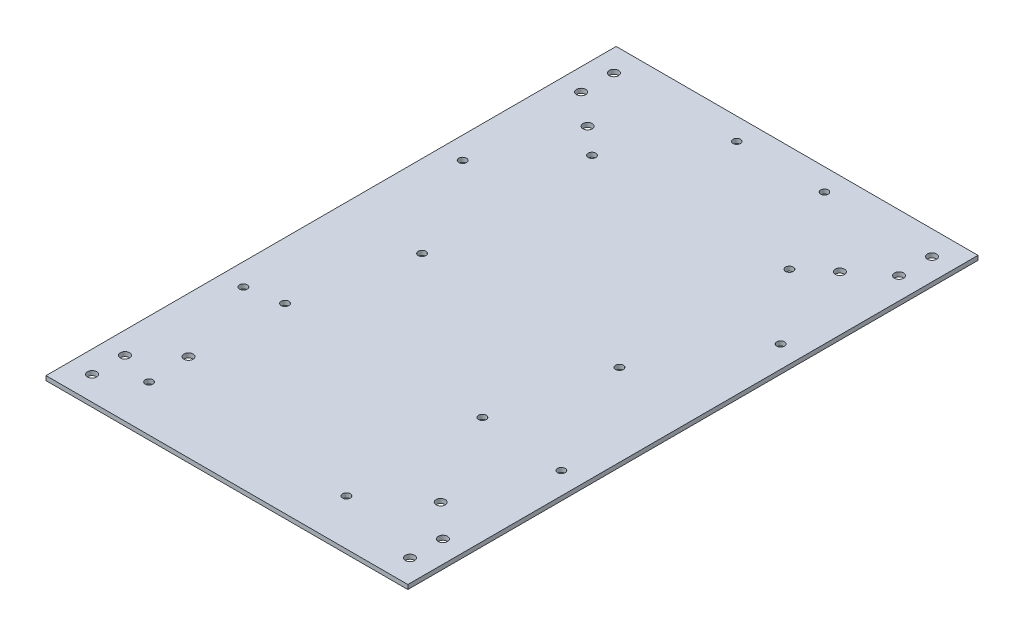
ISO-10303-21;
HEADER;
FILE_DESCRIPTION(('STEP AP214'),'2;1');
FILE_NAME('part.step','',(''),(''),'','','');
FILE_SCHEMA(('AUTOMOTIVE_DESIGN { 1 0 10303 214 1 1 1 1 }'));
ENDSEC;
DATA;
#1=APPLICATION_CONTEXT('core data for automotive mechanical design processes');
#2=APPLICATION_PROTOCOL_DEFINITION('international standard','automotive_design',2000,#1);
#3=PRODUCT_CONTEXT('',#1,'mechanical');
#4=PRODUCT('Part','Part','',(#3));
#5=PRODUCT_RELATED_PRODUCT_CATEGORY('part','',(#4));
#6=PRODUCT_DEFINITION_FORMATION('','',#4);
#7=PRODUCT_DEFINITION_CONTEXT('part definition',#1,'design');
#8=PRODUCT_DEFINITION('design','',#6,#7);
#9=PRODUCT_DEFINITION_SHAPE('','',#8);
#10=(LENGTH_UNIT() NAMED_UNIT(*) SI_UNIT(.MILLI.,.METRE.));
#11=(NAMED_UNIT(*) PLANE_ANGLE_UNIT() SI_UNIT($,.RADIAN.));
#12=(NAMED_UNIT(*) SI_UNIT($,.STERADIAN.) SOLID_ANGLE_UNIT());
#13=UNCERTAINTY_MEASURE_WITH_UNIT(LENGTH_MEASURE(1.E-05),#10,'distance_accuracy_value','');
#14=(GEOMETRIC_REPRESENTATION_CONTEXT(3) GLOBAL_UNCERTAINTY_ASSIGNED_CONTEXT((#13)) GLOBAL_UNIT_ASSIGNED_CONTEXT((#10,
#11,#12)) REPRESENTATION_CONTEXT('',''));
#15=CARTESIAN_POINT('',(0.,0.,0.));
#16=DIRECTION('',(0.,0.,1.));
#17=DIRECTION('',(1.,0.,0.));
#18=AXIS2_PLACEMENT_3D('',#15,#16,#17);
#19=CARTESIAN_POINT('',(82.,-2.,-122.55705739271));
#20=DIRECTION('',(1.,0.,0.));
#21=DIRECTION('',(0.,0.,-1.));
#22=AXIS2_PLACEMENT_3D('',#19,#20,#21);
#23=PLANE('',#22);
#24=DIRECTION('',(0.,0.,-1.));
#25=VECTOR('',#24,1.);
#26=CARTESIAN_POINT('',(82.,0.,-122.55705739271));
#27=LINE('',#26,#25);
#28=CARTESIAN_POINT('',(82.,0.,137.44294260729));
#29=VERTEX_POINT('',#28);
#30=CARTESIAN_POINT('',(82.,0.,-122.55705739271));
#31=VERTEX_POINT('',#30);
#32=EDGE_CURVE('E104',#29,#31,#27,.T.);
#33=ORIENTED_EDGE('',*,*,#32,.F.);
#34=DIRECTION('',(0.,1.,0.));
#35=VECTOR('',#34,1.);
#36=CARTESIAN_POINT('',(82.,-2.,137.44294260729));
#37=LINE('',#36,#35);
#38=CARTESIAN_POINT('',(82.,-2.,137.44294260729));
#39=VERTEX_POINT('',#38);
#40=EDGE_CURVE('E11',#39,#29,#37,.T.);
#41=ORIENTED_EDGE('',*,*,#40,.F.);
#42=DIRECTION('',(0.,0.,-1.));
#43=VECTOR('',#42,1.);
#44=CARTESIAN_POINT('',(82.,-2.,-122.55705739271));
#45=LINE('',#44,#43);
#46=CARTESIAN_POINT('',(82.,-2.,-122.55705739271));
#47=VERTEX_POINT('',#46);
#48=EDGE_CURVE('E97',#39,#47,#45,.T.);
#49=ORIENTED_EDGE('',*,*,#48,.T.);
#50=DIRECTION('',(0.,1.,0.));
#51=VECTOR('',#50,1.);
#52=CARTESIAN_POINT('',(82.,-2.,-122.55705739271));
#53=LINE('',#52,#51);
#54=EDGE_CURVE('E42',#47,#31,#53,.T.);
#55=ORIENTED_EDGE('',*,*,#54,.T.);
#56=EDGE_LOOP('',(#33,#41,#49,#55));
#57=FACE_BOUND('',#56,.T.);
#58=ADVANCED_FACE('F39',(#57),#23,.T.);
#59=CARTESIAN_POINT('',(-83.,-2.,137.44294260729));
#60=DIRECTION('',(0.,0.,1.));
#61=DIRECTION('',(1.,0.,0.));
#62=AXIS2_PLACEMENT_3D('',#59,#60,#61);
#63=PLANE('',#62);
#64=DIRECTION('',(1.,0.,0.));
#65=VECTOR('',#64,1.);
#66=CARTESIAN_POINT('',(-83.,0.,137.44294260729));
#67=LINE('',#66,#65);
#68=CARTESIAN_POINT('',(-83.,0.,137.44294260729));
#69=VERTEX_POINT('',#68);
#70=EDGE_CURVE('E99',#69,#29,#67,.T.);
#71=ORIENTED_EDGE('',*,*,#70,.F.);
#72=DIRECTION('',(0.,1.,0.));
#73=VECTOR('',#72,1.);
#74=CARTESIAN_POINT('',(-83.,-2.,137.44294260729));
#75=LINE('',#74,#73);
#76=CARTESIAN_POINT('',(-83.,-2.,137.44294260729));
#77=VERTEX_POINT('',#76);
#78=EDGE_CURVE('E48',#77,#69,#75,.T.);
#79=ORIENTED_EDGE('',*,*,#78,.F.);
#80=DIRECTION('',(1.,0.,0.));
#81=VECTOR('',#80,1.);
#82=CARTESIAN_POINT('',(-83.,-2.,137.44294260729));
#83=LINE('',#82,#81);
#84=EDGE_CURVE('E94',#77,#39,#83,.T.);
#85=ORIENTED_EDGE('',*,*,#84,.T.);
#86=ORIENTED_EDGE('',*,*,#40,.T.);
#87=EDGE_LOOP('',(#71,#79,#85,#86));
#88=FACE_BOUND('',#87,.T.);
#89=ADVANCED_FACE('F115',(#88),#63,.T.);
#90=CARTESIAN_POINT('',(-83.,-2.,-122.55705739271));
#91=DIRECTION('',(-1.,0.,0.));
#92=DIRECTION('',(0.,0.,1.));
#93=AXIS2_PLACEMENT_3D('',#90,#91,#92);
#94=PLANE('',#93);
#95=DIRECTION('',(0.,0.,1.));
#96=VECTOR('',#95,1.);
#97=CARTESIAN_POINT('',(-83.,0.,-122.55705739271));
#98=LINE('',#97,#96);
#99=CARTESIAN_POINT('',(-83.,0.,-122.55705739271));
#100=VERTEX_POINT('',#99);
#101=EDGE_CURVE('E89',#100,#69,#98,.T.);
#102=ORIENTED_EDGE('',*,*,#101,.F.);
#103=DIRECTION('',(0.,1.,0.));
#104=VECTOR('',#103,1.);
#105=CARTESIAN_POINT('',(-83.,-2.,-122.55705739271));
#106=LINE('',#105,#104);
#107=CARTESIAN_POINT('',(-83.,-2.,-122.55705739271));
#108=VERTEX_POINT('',#107);
#109=EDGE_CURVE('E84',#108,#100,#106,.T.);
#110=ORIENTED_EDGE('',*,*,#109,.F.);
#111=DIRECTION('',(0.,0.,1.));
#112=VECTOR('',#111,1.);
#113=CARTESIAN_POINT('',(-83.,-2.,-122.55705739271));
#114=LINE('',#113,#112);
#115=EDGE_CURVE('E87',#108,#77,#114,.T.);
#116=ORIENTED_EDGE('',*,*,#115,.T.);
#117=ORIENTED_EDGE('',*,*,#78,.T.);
#118=EDGE_LOOP('',(#102,#110,#116,#117));
#119=FACE_BOUND('',#118,.T.);
#120=ADVANCED_FACE('F86',(#119),#94,.T.);
#121=CARTESIAN_POINT('',(-83.,-2.,-122.55705739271));
#122=DIRECTION('',(0.,0.,-1.));
#123=DIRECTION('',(-1.,0.,0.));
#124=AXIS2_PLACEMENT_3D('',#121,#122,#123);
#125=PLANE('',#124);
#126=DIRECTION('',(-1.,0.,0.));
#127=VECTOR('',#126,1.);
#128=CARTESIAN_POINT('',(-83.,0.,-122.55705739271));
#129=LINE('',#128,#127);
#130=EDGE_CURVE('E107',#31,#100,#129,.T.);
#131=ORIENTED_EDGE('',*,*,#130,.F.);
#132=ORIENTED_EDGE('',*,*,#54,.F.);
#133=DIRECTION('',(-1.,0.,0.));
#134=VECTOR('',#133,1.);
#135=CARTESIAN_POINT('',(-83.,-2.,-122.55705739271));
#136=LINE('',#135,#134);
#137=EDGE_CURVE('E93',#47,#108,#136,.T.);
#138=ORIENTED_EDGE('',*,*,#137,.T.);
#139=ORIENTED_EDGE('',*,*,#109,.T.);
#140=EDGE_LOOP('',(#131,#132,#138,#139));
#141=FACE_BOUND('',#140,.T.);
#142=ADVANCED_FACE('F96',(#141),#125,.T.);
#143=CARTESIAN_POINT('',(0.,-2.,0.));
#144=DIRECTION('',(0.,1.,0.));
#145=DIRECTION('',(0.,0.,1.));
#146=AXIS2_PLACEMENT_3D('',#143,#144,#145);
#147=PLANE('',#146);
#148=CARTESIAN_POINT('',(22.,-2.,-112.55705739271));
#149=DIRECTION('',(0.,1.,0.));
#150=DIRECTION('',(0.,0.,1.));
#151=AXIS2_PLACEMENT_3D('',#148,#149,#150);
#152=CIRCLE('',#151,1.70000000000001);
#153=CARTESIAN_POINT('',(22.,-2.,-110.85705739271));
#154=VERTEX_POINT('',#153);
#155=EDGE_CURVE('E273',#154,#154,#152,.F.);
#156=ORIENTED_EDGE('',*,*,#155,.F.);
#157=EDGE_LOOP('',(#156));
#158=FACE_BOUND('',#157,.T.);
#159=CARTESIAN_POINT('',(-18.,-2.,-112.55705739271));
#160=DIRECTION('',(0.,1.,0.));
#161=DIRECTION('',(0.,0.,1.));
#162=AXIS2_PLACEMENT_3D('',#159,#160,#161);
#163=CIRCLE('',#162,1.70000000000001);
#164=CARTESIAN_POINT('',(-18.,-2.,-110.85705739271));
#165=VERTEX_POINT('',#164);
#166=EDGE_CURVE('E267',#165,#165,#163,.F.);
#167=ORIENTED_EDGE('',*,*,#166,.F.);
#168=EDGE_LOOP('',(#167));
#169=FACE_BOUND('',#168,.T.);
#170=CARTESIAN_POINT('',(44.5,-2.,-74.0570573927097));
#171=DIRECTION('',(0.,1.,0.));
#172=DIRECTION('',(0.,0.,1.));
#173=AXIS2_PLACEMENT_3D('',#170,#171,#172);
#174=CIRCLE('',#173,1.75);
#175=CARTESIAN_POINT('',(44.5,-2.,-72.3070573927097));
#176=VERTEX_POINT('',#175);
#177=EDGE_CURVE('E261',#176,#176,#174,.F.);
#178=ORIENTED_EDGE('',*,*,#177,.F.);
#179=EDGE_LOOP('',(#178));
#180=FACE_BOUND('',#179,.T.);
#181=CARTESIAN_POINT('',(-45.5,-2.,-74.0570573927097));
#182=DIRECTION('',(0.,1.,0.));
#183=DIRECTION('',(0.,0.,1.));
#184=AXIS2_PLACEMENT_3D('',#181,#182,#183);
#185=CIRCLE('',#184,1.75);
#186=CARTESIAN_POINT('',(-45.5,-2.,-72.3070573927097));
#187=VERTEX_POINT('',#186);
#188=EDGE_CURVE('E255',#187,#187,#185,.F.);
#189=ORIENTED_EDGE('',*,*,#188,.F.);
#190=EDGE_LOOP('',(#189));
#191=FACE_BOUND('',#190,.T.);
#192=CARTESIAN_POINT('',(-45.5000000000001,-2.,3.4429426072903));
#193=DIRECTION('',(0.,1.,0.));
#194=DIRECTION('',(0.,0.,1.));
#195=AXIS2_PLACEMENT_3D('',#192,#193,#194);
#196=CIRCLE('',#195,1.75);
#197=CARTESIAN_POINT('',(-45.5000000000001,-2.,5.1929426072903));
#198=VERTEX_POINT('',#197);
#199=EDGE_CURVE('E248',#198,#198,#196,.F.);
#200=ORIENTED_EDGE('',*,*,#199,.F.);
#201=EDGE_LOOP('',(#200));
#202=FACE_BOUND('',#201,.T.);
#203=CARTESIAN_POINT('',(-57.,-2.,54.4429426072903));
#204=DIRECTION('',(0.,1.,0.));
#205=DIRECTION('',(0.,0.,1.));
#206=AXIS2_PLACEMENT_3D('',#203,#204,#205);
#207=CIRCLE('',#206,1.75);
#208=CARTESIAN_POINT('',(-57.,-2.,56.1929426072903));
#209=VERTEX_POINT('',#208);
#210=EDGE_CURVE('E293',#209,#209,#207,.F.);
#211=ORIENTED_EDGE('',*,*,#210,.F.);
#212=EDGE_LOOP('',(#211));
#213=FACE_BOUND('',#212,.T.);
#214=CARTESIAN_POINT('',(33.,-2.,54.4429426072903));
#215=DIRECTION('',(0.,1.,0.));
#216=DIRECTION('',(0.,0.,1.));
#217=AXIS2_PLACEMENT_3D('',#214,#215,#216);
#218=CIRCLE('',#217,1.75);
#219=CARTESIAN_POINT('',(33.,-2.,56.1929426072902));
#220=VERTEX_POINT('',#219);
#221=EDGE_CURVE('E294',#220,#220,#218,.F.);
#222=ORIENTED_EDGE('',*,*,#221,.F.);
#223=EDGE_LOOP('',(#222));
#224=FACE_BOUND('',#223,.T.);
#225=CARTESIAN_POINT('',(33.,-2.,116.44294260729));
#226=DIRECTION('',(0.,1.,0.));
#227=DIRECTION('',(0.,0.,1.));
#228=AXIS2_PLACEMENT_3D('',#225,#226,#227);
#229=CIRCLE('',#228,1.75);
#230=CARTESIAN_POINT('',(33.,-2.,118.19294260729));
#231=VERTEX_POINT('',#230);
#232=EDGE_CURVE('E284',#231,#231,#229,.F.);
#233=ORIENTED_EDGE('',*,*,#232,.F.);
#234=EDGE_LOOP('',(#233));
#235=FACE_BOUND('',#234,.T.);
#236=CARTESIAN_POINT('',(44.4999999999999,-2.,3.44294260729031));
#237=DIRECTION('',(0.,1.,0.));
#238=DIRECTION('',(0.,0.,1.));
#239=AXIS2_PLACEMENT_3D('',#236,#237,#238);
#240=CIRCLE('',#239,1.75);
#241=CARTESIAN_POINT('',(44.4999999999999,-2.,5.19294260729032));
#242=VERTEX_POINT('',#241);
#243=EDGE_CURVE('E253',#242,#242,#240,.F.);
#244=ORIENTED_EDGE('',*,*,#243,.F.);
#245=EDGE_LOOP('',(#244));
#246=FACE_BOUND('',#245,.T.);
#247=CARTESIAN_POINT('',(-57.,-2.,116.44294260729));
#248=DIRECTION('',(0.,1.,0.));
#249=DIRECTION('',(0.,0.,1.));
#250=AXIS2_PLACEMENT_3D('',#247,#248,#249);
#251=CIRCLE('',#250,1.75);
#252=CARTESIAN_POINT('',(-57.,-2.,118.19294260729));
#253=VERTEX_POINT('',#252);
#254=EDGE_CURVE('E304',#253,#253,#251,.F.);
#255=ORIENTED_EDGE('',*,*,#254,.F.);
#256=EDGE_LOOP('',(#255));
#257=FACE_BOUND('',#256,.T.);
#258=CARTESIAN_POINT('',(72.,-2.,-111.55705739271));
#259=DIRECTION('',(0.,1.,0.));
#260=DIRECTION('',(0.,0.,-1.));
#261=AXIS2_PLACEMENT_3D('',#258,#259,#260);
#262=CIRCLE('',#261,2.1);
#263=CARTESIAN_POINT('',(72.,-2.,-113.65705739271));
#264=VERTEX_POINT('',#263);
#265=EDGE_CURVE('E308',#264,#264,#262,.T.);
#266=ORIENTED_EDGE('',*,*,#265,.T.);
#267=EDGE_LOOP('',(#266));
#268=FACE_BOUND('',#267,.T.);
#269=CARTESIAN_POINT('',(-73.,-2.,-111.55705739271));
#270=DIRECTION('',(0.,1.,0.));
#271=DIRECTION('',(0.,0.,1.));
#272=AXIS2_PLACEMENT_3D('',#269,#270,#271);
#273=CIRCLE('',#272,2.1);
#274=CARTESIAN_POINT('',(-73.,-2.,-109.45705739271));
#275=VERTEX_POINT('',#274);
#276=EDGE_CURVE('E314',#275,#275,#273,.T.);
#277=ORIENTED_EDGE('',*,*,#276,.T.);
#278=EDGE_LOOP('',(#277));
#279=FACE_BOUND('',#278,.T.);
#280=CARTESIAN_POINT('',(72.,-2.,126.44294260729));
#281=DIRECTION('',(0.,1.,0.));
#282=DIRECTION('',(0.,0.,-1.));
#283=AXIS2_PLACEMENT_3D('',#280,#281,#282);
#284=CIRCLE('',#283,2.1);
#285=CARTESIAN_POINT('',(72.,-2.,124.34294260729));
#286=VERTEX_POINT('',#285);
#287=EDGE_CURVE('E320',#286,#286,#284,.T.);
#288=ORIENTED_EDGE('',*,*,#287,.T.);
#289=EDGE_LOOP('',(#288));
#290=FACE_BOUND('',#289,.T.);
#291=CARTESIAN_POINT('',(72.,-2.,111.44294260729));
#292=DIRECTION('',(0.,1.,0.));
#293=DIRECTION('',(0.,0.,-1.));
#294=AXIS2_PLACEMENT_3D('',#291,#292,#293);
#295=CIRCLE('',#294,2.1);
#296=CARTESIAN_POINT('',(72.,-2.,109.34294260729));
#297=VERTEX_POINT('',#296);
#298=EDGE_CURVE('E326',#297,#297,#295,.T.);
#299=ORIENTED_EDGE('',*,*,#298,.T.);
#300=EDGE_LOOP('',(#299));
#301=FACE_BOUND('',#300,.T.);
#302=CARTESIAN_POINT('',(72.,-2.,57.4429426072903));
#303=DIRECTION('',(0.,1.,0.));
#304=DIRECTION('',(0.,0.,-1.));
#305=AXIS2_PLACEMENT_3D('',#302,#303,#304);
#306=CIRCLE('',#305,1.75);
#307=CARTESIAN_POINT('',(72.,-2.,55.6929426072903));
#308=VERTEX_POINT('',#307);
#309=EDGE_CURVE('E332',#308,#308,#306,.T.);
#310=ORIENTED_EDGE('',*,*,#309,.T.);
#311=EDGE_LOOP('',(#310));
#312=FACE_BOUND('',#311,.T.);
#313=CARTESIAN_POINT('',(-73.,-2.,111.44294260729));
#314=DIRECTION('',(0.,1.,0.));
#315=DIRECTION('',(0.,0.,1.));
#316=AXIS2_PLACEMENT_3D('',#313,#314,#315);
#317=CIRCLE('',#316,2.1);
#318=CARTESIAN_POINT('',(-73.,-2.,113.54294260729));
#319=VERTEX_POINT('',#318);
#320=EDGE_CURVE('E338',#319,#319,#317,.T.);
#321=ORIENTED_EDGE('',*,*,#320,.T.);
#322=EDGE_LOOP('',(#321));
#323=FACE_BOUND('',#322,.T.);
#324=CARTESIAN_POINT('',(72.,-2.,-96.5570573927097));
#325=DIRECTION('',(0.,1.,0.));
#326=DIRECTION('',(0.,0.,-1.));
#327=AXIS2_PLACEMENT_3D('',#324,#325,#326);
#328=CIRCLE('',#327,2.1);
#329=CARTESIAN_POINT('',(72.,-2.,-98.6570573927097));
#330=VERTEX_POINT('',#329);
#331=EDGE_CURVE('E344',#330,#330,#328,.T.);
#332=ORIENTED_EDGE('',*,*,#331,.T.);
#333=EDGE_LOOP('',(#332));
#334=FACE_BOUND('',#333,.T.);
#335=CARTESIAN_POINT('',(72.,-2.,-42.5570573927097));
#336=DIRECTION('',(0.,1.,0.));
#337=DIRECTION('',(0.,0.,-1.));
#338=AXIS2_PLACEMENT_3D('',#335,#336,#337);
#339=CIRCLE('',#338,1.75);
#340=CARTESIAN_POINT('',(72.,-2.,-44.3070573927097));
#341=VERTEX_POINT('',#340);
#342=EDGE_CURVE('E350',#341,#341,#339,.T.);
#343=ORIENTED_EDGE('',*,*,#342,.T.);
#344=EDGE_LOOP('',(#343));
#345=FACE_BOUND('',#344,.T.);
#346=CARTESIAN_POINT('',(-73.,-2.,-96.5570573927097));
#347=DIRECTION('',(0.,1.,0.));
#348=DIRECTION('',(0.,0.,1.));
#349=AXIS2_PLACEMENT_3D('',#346,#347,#348);
#350=CIRCLE('',#349,2.1);
#351=CARTESIAN_POINT('',(-73.,-2.,-94.4570573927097));
#352=VERTEX_POINT('',#351);
#353=EDGE_CURVE('E356',#352,#352,#350,.T.);
#354=ORIENTED_EDGE('',*,*,#353,.T.);
#355=EDGE_LOOP('',(#354));
#356=FACE_BOUND('',#355,.T.);
#357=CARTESIAN_POINT('',(-73.,-2.,126.44294260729));
#358=DIRECTION('',(0.,1.,0.));
#359=DIRECTION('',(0.,0.,1.));
#360=AXIS2_PLACEMENT_3D('',#357,#358,#359);
#361=CIRCLE('',#360,2.1);
#362=CARTESIAN_POINT('',(-73.,-2.,128.54294260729));
#363=VERTEX_POINT('',#362);
#364=EDGE_CURVE('E362',#363,#363,#361,.T.);
#365=ORIENTED_EDGE('',*,*,#364,.T.);
#366=EDGE_LOOP('',(#365));
#367=FACE_BOUND('',#366,.T.);
#368=CARTESIAN_POINT('',(-73.,-2.,57.4429426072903));
#369=DIRECTION('',(0.,1.,0.));
#370=DIRECTION('',(0.,0.,1.));
#371=AXIS2_PLACEMENT_3D('',#368,#369,#370);
#372=CIRCLE('',#371,1.75);
#373=CARTESIAN_POINT('',(-73.,-2.,59.1929426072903));
#374=VERTEX_POINT('',#373);
#375=EDGE_CURVE('E368',#374,#374,#372,.T.);
#376=ORIENTED_EDGE('',*,*,#375,.T.);
#377=EDGE_LOOP('',(#376));
#378=FACE_BOUND('',#377,.T.);
#379=CARTESIAN_POINT('',(-73.,-2.,-42.5570573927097));
#380=DIRECTION('',(0.,1.,0.));
#381=DIRECTION('',(0.,0.,1.));
#382=AXIS2_PLACEMENT_3D('',#379,#380,#381);
#383=CIRCLE('',#382,1.75);
#384=CARTESIAN_POINT('',(-73.,-2.,-40.8070573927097));
#385=VERTEX_POINT('',#384);
#386=EDGE_CURVE('E374',#385,#385,#383,.T.);
#387=ORIENTED_EDGE('',*,*,#386,.T.);
#388=EDGE_LOOP('',(#387));
#389=FACE_BOUND('',#388,.T.);
#390=CARTESIAN_POINT('',(-58.,-2.,97.4429426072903));
#391=DIRECTION('',(0.,1.,0.));
#392=DIRECTION('',(0.,0.,1.));
#393=AXIS2_PLACEMENT_3D('',#390,#391,#392);
#394=CIRCLE('',#393,2.1);
#395=CARTESIAN_POINT('',(-58.,-2.,99.5429426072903));
#396=VERTEX_POINT('',#395);
#397=EDGE_CURVE('E380',#396,#396,#394,.T.);
#398=ORIENTED_EDGE('',*,*,#397,.T.);
#399=EDGE_LOOP('',(#398));
#400=FACE_BOUND('',#399,.T.);
#401=CARTESIAN_POINT('',(57.,-2.,97.4429426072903));
#402=DIRECTION('',(0.,1.,0.));
#403=DIRECTION('',(0.,0.,1.));
#404=AXIS2_PLACEMENT_3D('',#401,#402,#403);
#405=CIRCLE('',#404,2.1);
#406=CARTESIAN_POINT('',(57.,-2.,99.5429426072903));
#407=VERTEX_POINT('',#406);
#408=EDGE_CURVE('E386',#407,#407,#405,.T.);
#409=ORIENTED_EDGE('',*,*,#408,.T.);
#410=EDGE_LOOP('',(#409));
#411=FACE_BOUND('',#410,.T.);
#412=CARTESIAN_POINT('',(57.,-2.,-84.5570573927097));
#413=DIRECTION('',(0.,1.,0.));
#414=DIRECTION('',(0.,0.,1.));
#415=AXIS2_PLACEMENT_3D('',#412,#413,#414);
#416=CIRCLE('',#415,2.1);
#417=CARTESIAN_POINT('',(57.,-2.,-82.4570573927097));
#418=VERTEX_POINT('',#417);
#419=EDGE_CURVE('E392',#418,#418,#416,.T.);
#420=ORIENTED_EDGE('',*,*,#419,.T.);
#421=EDGE_LOOP('',(#420));
#422=FACE_BOUND('',#421,.T.);
#423=CARTESIAN_POINT('',(-58.,-2.,-84.5570573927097));
#424=DIRECTION('',(0.,1.,0.));
#425=DIRECTION('',(0.,0.,1.));
#426=AXIS2_PLACEMENT_3D('',#423,#424,#425);
#427=CIRCLE('',#426,2.1);
#428=CARTESIAN_POINT('',(-58.,-2.,-82.4570573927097));
#429=VERTEX_POINT('',#428);
#430=EDGE_CURVE('E108',#429,#429,#427,.T.);
#431=ORIENTED_EDGE('',*,*,#430,.T.);
#432=EDGE_LOOP('',(#431));
#433=FACE_BOUND('',#432,.T.);
#434=ORIENTED_EDGE('',*,*,#48,.F.);
#435=ORIENTED_EDGE('',*,*,#84,.F.);
#436=ORIENTED_EDGE('',*,*,#115,.F.);
#437=ORIENTED_EDGE('',*,*,#137,.F.);
#438=EDGE_LOOP('',(#434,#435,#436,#437));
#439=FACE_BOUND('',#438,.T.);
#440=ADVANCED_FACE('F92',(#158,#169,#180,#191,#202,#213,#224,#235,#246,#257,#268,#279,#290,#301,
#312,#323,#334,#345,#356,#367,#378,#389,#400,#411,#422,#433,#439),#147,.F.);
#441=CARTESIAN_POINT('',(0.,0.,0.));
#442=DIRECTION('',(0.,1.,0.));
#443=DIRECTION('',(0.,0.,1.));
#444=AXIS2_PLACEMENT_3D('',#441,#442,#443);
#445=PLANE('',#444);
#446=CARTESIAN_POINT('',(22.,0.,-112.55705739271));
#447=DIRECTION('',(0.,1.,0.));
#448=DIRECTION('',(0.,0.,1.));
#449=AXIS2_PLACEMENT_3D('',#446,#447,#448);
#450=CIRCLE('',#449,1.70000000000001);
#451=CARTESIAN_POINT('',(22.,0.,-110.85705739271));
#452=VERTEX_POINT('',#451);
#453=EDGE_CURVE('E276',#452,#452,#450,.T.);
#454=ORIENTED_EDGE('',*,*,#453,.F.);
#455=EDGE_LOOP('',(#454));
#456=FACE_BOUND('',#455,.T.);
#457=CARTESIAN_POINT('',(-18.,0.,-112.55705739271));
#458=DIRECTION('',(0.,1.,0.));
#459=DIRECTION('',(0.,0.,1.));
#460=AXIS2_PLACEMENT_3D('',#457,#458,#459);
#461=CIRCLE('',#460,1.70000000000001);
#462=CARTESIAN_POINT('',(-18.,0.,-110.85705739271));
#463=VERTEX_POINT('',#462);
#464=EDGE_CURVE('E270',#463,#463,#461,.T.);
#465=ORIENTED_EDGE('',*,*,#464,.F.);
#466=EDGE_LOOP('',(#465));
#467=FACE_BOUND('',#466,.T.);
#468=CARTESIAN_POINT('',(44.5,0.,-74.0570573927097));
#469=DIRECTION('',(0.,1.,0.));
#470=DIRECTION('',(0.,0.,1.));
#471=AXIS2_PLACEMENT_3D('',#468,#469,#470);
#472=CIRCLE('',#471,1.75);
#473=CARTESIAN_POINT('',(44.5,0.,-72.3070573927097));
#474=VERTEX_POINT('',#473);
#475=EDGE_CURVE('E264',#474,#474,#472,.T.);
#476=ORIENTED_EDGE('',*,*,#475,.F.);
#477=EDGE_LOOP('',(#476));
#478=FACE_BOUND('',#477,.T.);
#479=CARTESIAN_POINT('',(-45.5,0.,-74.0570573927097));
#480=DIRECTION('',(0.,1.,0.));
#481=DIRECTION('',(0.,0.,1.));
#482=AXIS2_PLACEMENT_3D('',#479,#480,#481);
#483=CIRCLE('',#482,1.75);
#484=CARTESIAN_POINT('',(-45.5,0.,-72.3070573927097));
#485=VERTEX_POINT('',#484);
#486=EDGE_CURVE('E258',#485,#485,#483,.T.);
#487=ORIENTED_EDGE('',*,*,#486,.F.);
#488=EDGE_LOOP('',(#487));
#489=FACE_BOUND('',#488,.T.);
#490=CARTESIAN_POINT('',(-45.5000000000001,0.,3.4429426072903));
#491=DIRECTION('',(0.,1.,0.));
#492=DIRECTION('',(0.,0.,1.));
#493=AXIS2_PLACEMENT_3D('',#490,#491,#492);
#494=CIRCLE('',#493,1.75);
#495=CARTESIAN_POINT('',(-45.5000000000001,0.,5.1929426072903));
#496=VERTEX_POINT('',#495);
#497=EDGE_CURVE('E245',#496,#496,#494,.T.);
#498=ORIENTED_EDGE('',*,*,#497,.F.);
#499=EDGE_LOOP('',(#498));
#500=FACE_BOUND('',#499,.T.);
#501=CARTESIAN_POINT('',(-57.,0.,54.4429426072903));
#502=DIRECTION('',(0.,1.,0.));
#503=DIRECTION('',(0.,0.,1.));
#504=AXIS2_PLACEMENT_3D('',#501,#502,#503);
#505=CIRCLE('',#504,1.75);
#506=CARTESIAN_POINT('',(-57.,0.,56.1929426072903));
#507=VERTEX_POINT('',#506);
#508=EDGE_CURVE('E290',#507,#507,#505,.T.);
#509=ORIENTED_EDGE('',*,*,#508,.F.);
#510=EDGE_LOOP('',(#509));
#511=FACE_BOUND('',#510,.T.);
#512=CARTESIAN_POINT('',(33.,0.,54.4429426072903));
#513=DIRECTION('',(0.,1.,0.));
#514=DIRECTION('',(0.,0.,1.));
#515=AXIS2_PLACEMENT_3D('',#512,#513,#514);
#516=CIRCLE('',#515,1.75);
#517=CARTESIAN_POINT('',(33.,0.,56.1929426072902));
#518=VERTEX_POINT('',#517);
#519=EDGE_CURVE('E286',#518,#518,#516,.T.);
#520=ORIENTED_EDGE('',*,*,#519,.F.);
#521=EDGE_LOOP('',(#520));
#522=FACE_BOUND('',#521,.T.);
#523=CARTESIAN_POINT('',(33.,0.,116.44294260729));
#524=DIRECTION('',(0.,1.,0.));
#525=DIRECTION('',(0.,0.,1.));
#526=AXIS2_PLACEMENT_3D('',#523,#524,#525);
#527=CIRCLE('',#526,1.75);
#528=CARTESIAN_POINT('',(33.,0.,118.19294260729));
#529=VERTEX_POINT('',#528);
#530=EDGE_CURVE('E281',#529,#529,#527,.T.);
#531=ORIENTED_EDGE('',*,*,#530,.F.);
#532=EDGE_LOOP('',(#531));
#533=FACE_BOUND('',#532,.T.);
#534=CARTESIAN_POINT('',(44.4999999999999,0.,3.44294260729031));
#535=DIRECTION('',(0.,1.,0.));
#536=DIRECTION('',(0.,0.,1.));
#537=AXIS2_PLACEMENT_3D('',#534,#535,#536);
#538=CIRCLE('',#537,1.75);
#539=CARTESIAN_POINT('',(44.4999999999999,0.,5.19294260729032));
#540=VERTEX_POINT('',#539);
#541=EDGE_CURVE('E250',#540,#540,#538,.T.);
#542=ORIENTED_EDGE('',*,*,#541,.F.);
#543=EDGE_LOOP('',(#542));
#544=FACE_BOUND('',#543,.T.);
#545=CARTESIAN_POINT('',(-57.,0.,116.44294260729));
#546=DIRECTION('',(0.,1.,0.));
#547=DIRECTION('',(0.,0.,1.));
#548=AXIS2_PLACEMENT_3D('',#545,#546,#547);
#549=CIRCLE('',#548,1.75);
#550=CARTESIAN_POINT('',(-57.,0.,118.19294260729));
#551=VERTEX_POINT('',#550);
#552=EDGE_CURVE('E297',#551,#551,#549,.T.);
#553=ORIENTED_EDGE('',*,*,#552,.F.);
#554=EDGE_LOOP('',(#553));
#555=FACE_BOUND('',#554,.T.);
#556=CARTESIAN_POINT('',(72.,0.,-111.55705739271));
#557=DIRECTION('',(0.,1.,0.));
#558=DIRECTION('',(0.,0.,-1.));
#559=AXIS2_PLACEMENT_3D('',#556,#557,#558);
#560=CIRCLE('',#559,2.1);
#561=CARTESIAN_POINT('',(72.,0.,-113.65705739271));
#562=VERTEX_POINT('',#561);
#563=EDGE_CURVE('E307',#562,#562,#560,.T.);
#564=ORIENTED_EDGE('',*,*,#563,.F.);
#565=EDGE_LOOP('',(#564));
#566=FACE_BOUND('',#565,.T.);
#567=CARTESIAN_POINT('',(-73.,0.,-111.55705739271));
#568=DIRECTION('',(0.,1.,0.));
#569=DIRECTION('',(0.,0.,1.));
#570=AXIS2_PLACEMENT_3D('',#567,#568,#569);
#571=CIRCLE('',#570,2.1);
#572=CARTESIAN_POINT('',(-73.,0.,-109.45705739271));
#573=VERTEX_POINT('',#572);
#574=EDGE_CURVE('E311',#573,#573,#571,.T.);
#575=ORIENTED_EDGE('',*,*,#574,.F.);
#576=EDGE_LOOP('',(#575));
#577=FACE_BOUND('',#576,.T.);
#578=CARTESIAN_POINT('',(72.,0.,126.44294260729));
#579=DIRECTION('',(0.,1.,0.));
#580=DIRECTION('',(0.,0.,-1.));
#581=AXIS2_PLACEMENT_3D('',#578,#579,#580);
#582=CIRCLE('',#581,2.1);
#583=CARTESIAN_POINT('',(72.,0.,124.34294260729));
#584=VERTEX_POINT('',#583);
#585=EDGE_CURVE('E317',#584,#584,#582,.T.);
#586=ORIENTED_EDGE('',*,*,#585,.F.);
#587=EDGE_LOOP('',(#586));
#588=FACE_BOUND('',#587,.T.);
#589=CARTESIAN_POINT('',(72.,0.,111.44294260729));
#590=DIRECTION('',(0.,1.,0.));
#591=DIRECTION('',(0.,0.,-1.));
#592=AXIS2_PLACEMENT_3D('',#589,#590,#591);
#593=CIRCLE('',#592,2.1);
#594=CARTESIAN_POINT('',(72.,0.,109.34294260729));
#595=VERTEX_POINT('',#594);
#596=EDGE_CURVE('E323',#595,#595,#593,.T.);
#597=ORIENTED_EDGE('',*,*,#596,.F.);
#598=EDGE_LOOP('',(#597));
#599=FACE_BOUND('',#598,.T.);
#600=CARTESIAN_POINT('',(72.,0.,57.4429426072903));
#601=DIRECTION('',(0.,1.,0.));
#602=DIRECTION('',(0.,0.,-1.));
#603=AXIS2_PLACEMENT_3D('',#600,#601,#602);
#604=CIRCLE('',#603,1.75);
#605=CARTESIAN_POINT('',(72.,0.,55.6929426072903));
#606=VERTEX_POINT('',#605);
#607=EDGE_CURVE('E329',#606,#606,#604,.T.);
#608=ORIENTED_EDGE('',*,*,#607,.F.);
#609=EDGE_LOOP('',(#608));
#610=FACE_BOUND('',#609,.T.);
#611=CARTESIAN_POINT('',(-73.,0.,111.44294260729));
#612=DIRECTION('',(0.,1.,0.));
#613=DIRECTION('',(0.,0.,1.));
#614=AXIS2_PLACEMENT_3D('',#611,#612,#613);
#615=CIRCLE('',#614,2.1);
#616=CARTESIAN_POINT('',(-73.,0.,113.54294260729));
#617=VERTEX_POINT('',#616);
#618=EDGE_CURVE('E335',#617,#617,#615,.T.);
#619=ORIENTED_EDGE('',*,*,#618,.F.);
#620=EDGE_LOOP('',(#619));
#621=FACE_BOUND('',#620,.T.);
#622=CARTESIAN_POINT('',(72.,0.,-96.5570573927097));
#623=DIRECTION('',(0.,1.,0.));
#624=DIRECTION('',(0.,0.,-1.));
#625=AXIS2_PLACEMENT_3D('',#622,#623,#624);
#626=CIRCLE('',#625,2.1);
#627=CARTESIAN_POINT('',(72.,0.,-98.6570573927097));
#628=VERTEX_POINT('',#627);
#629=EDGE_CURVE('E341',#628,#628,#626,.T.);
#630=ORIENTED_EDGE('',*,*,#629,.F.);
#631=EDGE_LOOP('',(#630));
#632=FACE_BOUND('',#631,.T.);
#633=CARTESIAN_POINT('',(72.,0.,-42.5570573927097));
#634=DIRECTION('',(0.,1.,0.));
#635=DIRECTION('',(0.,0.,-1.));
#636=AXIS2_PLACEMENT_3D('',#633,#634,#635);
#637=CIRCLE('',#636,1.75);
#638=CARTESIAN_POINT('',(72.,0.,-44.3070573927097));
#639=VERTEX_POINT('',#638);
#640=EDGE_CURVE('E347',#639,#639,#637,.T.);
#641=ORIENTED_EDGE('',*,*,#640,.F.);
#642=EDGE_LOOP('',(#641));
#643=FACE_BOUND('',#642,.T.);
#644=CARTESIAN_POINT('',(-73.,0.,-96.5570573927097));
#645=DIRECTION('',(0.,1.,0.));
#646=DIRECTION('',(0.,0.,1.));
#647=AXIS2_PLACEMENT_3D('',#644,#645,#646);
#648=CIRCLE('',#647,2.1);
#649=CARTESIAN_POINT('',(-73.,0.,-94.4570573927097));
#650=VERTEX_POINT('',#649);
#651=EDGE_CURVE('E353',#650,#650,#648,.T.);
#652=ORIENTED_EDGE('',*,*,#651,.F.);
#653=EDGE_LOOP('',(#652));
#654=FACE_BOUND('',#653,.T.);
#655=CARTESIAN_POINT('',(-73.,0.,126.44294260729));
#656=DIRECTION('',(0.,1.,0.));
#657=DIRECTION('',(0.,0.,1.));
#658=AXIS2_PLACEMENT_3D('',#655,#656,#657);
#659=CIRCLE('',#658,2.1);
#660=CARTESIAN_POINT('',(-73.,0.,128.54294260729));
#661=VERTEX_POINT('',#660);
#662=EDGE_CURVE('E359',#661,#661,#659,.T.);
#663=ORIENTED_EDGE('',*,*,#662,.F.);
#664=EDGE_LOOP('',(#663));
#665=FACE_BOUND('',#664,.T.);
#666=CARTESIAN_POINT('',(-73.,0.,57.4429426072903));
#667=DIRECTION('',(0.,1.,0.));
#668=DIRECTION('',(0.,0.,1.));
#669=AXIS2_PLACEMENT_3D('',#666,#667,#668);
#670=CIRCLE('',#669,1.75);
#671=CARTESIAN_POINT('',(-73.,0.,59.1929426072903));
#672=VERTEX_POINT('',#671);
#673=EDGE_CURVE('E365',#672,#672,#670,.T.);
#674=ORIENTED_EDGE('',*,*,#673,.F.);
#675=EDGE_LOOP('',(#674));
#676=FACE_BOUND('',#675,.T.);
#677=CARTESIAN_POINT('',(-73.,0.,-42.5570573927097));
#678=DIRECTION('',(0.,1.,0.));
#679=DIRECTION('',(0.,0.,1.));
#680=AXIS2_PLACEMENT_3D('',#677,#678,#679);
#681=CIRCLE('',#680,1.75);
#682=CARTESIAN_POINT('',(-73.,0.,-40.8070573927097));
#683=VERTEX_POINT('',#682);
#684=EDGE_CURVE('E371',#683,#683,#681,.T.);
#685=ORIENTED_EDGE('',*,*,#684,.F.);
#686=EDGE_LOOP('',(#685));
#687=FACE_BOUND('',#686,.T.);
#688=CARTESIAN_POINT('',(-58.,0.,97.4429426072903));
#689=DIRECTION('',(0.,1.,0.));
#690=DIRECTION('',(0.,0.,1.));
#691=AXIS2_PLACEMENT_3D('',#688,#689,#690);
#692=CIRCLE('',#691,2.1);
#693=CARTESIAN_POINT('',(-58.,0.,99.5429426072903));
#694=VERTEX_POINT('',#693);
#695=EDGE_CURVE('E377',#694,#694,#692,.T.);
#696=ORIENTED_EDGE('',*,*,#695,.F.);
#697=EDGE_LOOP('',(#696));
#698=FACE_BOUND('',#697,.T.);
#699=CARTESIAN_POINT('',(57.,0.,97.4429426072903));
#700=DIRECTION('',(0.,1.,0.));
#701=DIRECTION('',(0.,0.,1.));
#702=AXIS2_PLACEMENT_3D('',#699,#700,#701);
#703=CIRCLE('',#702,2.1);
#704=CARTESIAN_POINT('',(57.,0.,99.5429426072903));
#705=VERTEX_POINT('',#704);
#706=EDGE_CURVE('E383',#705,#705,#703,.T.);
#707=ORIENTED_EDGE('',*,*,#706,.F.);
#708=EDGE_LOOP('',(#707));
#709=FACE_BOUND('',#708,.T.);
#710=CARTESIAN_POINT('',(57.,0.,-84.5570573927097));
#711=DIRECTION('',(0.,1.,0.));
#712=DIRECTION('',(0.,0.,1.));
#713=AXIS2_PLACEMENT_3D('',#710,#711,#712);
#714=CIRCLE('',#713,2.1);
#715=CARTESIAN_POINT('',(57.,0.,-82.4570573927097));
#716=VERTEX_POINT('',#715);
#717=EDGE_CURVE('E389',#716,#716,#714,.T.);
#718=ORIENTED_EDGE('',*,*,#717,.F.);
#719=EDGE_LOOP('',(#718));
#720=FACE_BOUND('',#719,.T.);
#721=CARTESIAN_POINT('',(-58.,0.,-84.5570573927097));
#722=DIRECTION('',(0.,1.,0.));
#723=DIRECTION('',(0.,0.,1.));
#724=AXIS2_PLACEMENT_3D('',#721,#722,#723);
#725=CIRCLE('',#724,2.1);
#726=CARTESIAN_POINT('',(-58.,0.,-82.4570573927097));
#727=VERTEX_POINT('',#726);
#728=EDGE_CURVE('E395',#727,#727,#725,.T.);
#729=ORIENTED_EDGE('',*,*,#728,.F.);
#730=EDGE_LOOP('',(#729));
#731=FACE_BOUND('',#730,.T.);
#732=ORIENTED_EDGE('',*,*,#32,.T.);
#733=ORIENTED_EDGE('',*,*,#130,.T.);
#734=ORIENTED_EDGE('',*,*,#101,.T.);
#735=ORIENTED_EDGE('',*,*,#70,.T.);
#736=EDGE_LOOP('',(#732,#733,#734,#735));
#737=FACE_BOUND('',#736,.T.);
#738=ADVANCED_FACE('F114',(#456,#467,#478,#489,#500,#511,#522,#533,#544,#555,#566,#577,#588,
#599,#610,#621,#632,#643,#654,#665,#676,#687,#698,#709,#720,#731,#737),#445,.T.);
#739=CARTESIAN_POINT('',(-58.,-2.,-84.5570573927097));
#740=DIRECTION('',(0.,1.,0.));
#741=DIRECTION('',(0.,0.,1.));
#742=AXIS2_PLACEMENT_3D('',#739,#740,#741);
#743=CYLINDRICAL_SURFACE('',#742,2.1);
#744=ORIENTED_EDGE('',*,*,#430,.F.);
#745=EDGE_LOOP('',(#744));
#746=FACE_BOUND('',#745,.T.);
#747=ORIENTED_EDGE('',*,*,#728,.T.);
#748=EDGE_LOOP('',(#747));
#749=FACE_BOUND('',#748,.T.);
#750=ADVANCED_FACE('F133',(#746,#749),#743,.F.);
#751=CARTESIAN_POINT('',(57.,-2.,-84.5570573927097));
#752=DIRECTION('',(0.,1.,0.));
#753=DIRECTION('',(0.,0.,1.));
#754=AXIS2_PLACEMENT_3D('',#751,#752,#753);
#755=CYLINDRICAL_SURFACE('',#754,2.1);
#756=ORIENTED_EDGE('',*,*,#419,.F.);
#757=EDGE_LOOP('',(#756));
#758=FACE_BOUND('',#757,.T.);
#759=ORIENTED_EDGE('',*,*,#717,.T.);
#760=EDGE_LOOP('',(#759));
#761=FACE_BOUND('',#760,.T.);
#762=ADVANCED_FACE('F140',(#758,#761),#755,.F.);
#763=CARTESIAN_POINT('',(57.,-2.,97.4429426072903));
#764=DIRECTION('',(0.,1.,0.));
#765=DIRECTION('',(0.,0.,1.));
#766=AXIS2_PLACEMENT_3D('',#763,#764,#765);
#767=CYLINDRICAL_SURFACE('',#766,2.1);
#768=ORIENTED_EDGE('',*,*,#408,.F.);
#769=EDGE_LOOP('',(#768));
#770=FACE_BOUND('',#769,.T.);
#771=ORIENTED_EDGE('',*,*,#706,.T.);
#772=EDGE_LOOP('',(#771));
#773=FACE_BOUND('',#772,.T.);
#774=ADVANCED_FACE('F144',(#770,#773),#767,.F.);
#775=CARTESIAN_POINT('',(-58.,-2.,97.4429426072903));
#776=DIRECTION('',(0.,1.,0.));
#777=DIRECTION('',(0.,0.,1.));
#778=AXIS2_PLACEMENT_3D('',#775,#776,#777);
#779=CYLINDRICAL_SURFACE('',#778,2.1);
#780=ORIENTED_EDGE('',*,*,#397,.F.);
#781=EDGE_LOOP('',(#780));
#782=FACE_BOUND('',#781,.T.);
#783=ORIENTED_EDGE('',*,*,#695,.T.);
#784=EDGE_LOOP('',(#783));
#785=FACE_BOUND('',#784,.T.);
#786=ADVANCED_FACE('F148',(#782,#785),#779,.F.);
#787=CARTESIAN_POINT('',(-73.,-2.,-42.5570573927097));
#788=DIRECTION('',(0.,1.,0.));
#789=DIRECTION('',(0.,0.,1.));
#790=AXIS2_PLACEMENT_3D('',#787,#788,#789);
#791=CYLINDRICAL_SURFACE('',#790,1.75);
#792=ORIENTED_EDGE('',*,*,#386,.F.);
#793=EDGE_LOOP('',(#792));
#794=FACE_BOUND('',#793,.T.);
#795=ORIENTED_EDGE('',*,*,#684,.T.);
#796=EDGE_LOOP('',(#795));
#797=FACE_BOUND('',#796,.T.);
#798=ADVANCED_FACE('F152',(#794,#797),#791,.F.);
#799=CARTESIAN_POINT('',(-73.,-2.,57.4429426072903));
#800=DIRECTION('',(0.,1.,0.));
#801=DIRECTION('',(0.,0.,1.));
#802=AXIS2_PLACEMENT_3D('',#799,#800,#801);
#803=CYLINDRICAL_SURFACE('',#802,1.75);
#804=ORIENTED_EDGE('',*,*,#375,.F.);
#805=EDGE_LOOP('',(#804));
#806=FACE_BOUND('',#805,.T.);
#807=ORIENTED_EDGE('',*,*,#673,.T.);
#808=EDGE_LOOP('',(#807));
#809=FACE_BOUND('',#808,.T.);
#810=ADVANCED_FACE('F156',(#806,#809),#803,.F.);
#811=CARTESIAN_POINT('',(-73.,-2.,126.44294260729));
#812=DIRECTION('',(0.,1.,0.));
#813=DIRECTION('',(0.,0.,1.));
#814=AXIS2_PLACEMENT_3D('',#811,#812,#813);
#815=CYLINDRICAL_SURFACE('',#814,2.1);
#816=ORIENTED_EDGE('',*,*,#364,.F.);
#817=EDGE_LOOP('',(#816));
#818=FACE_BOUND('',#817,.T.);
#819=ORIENTED_EDGE('',*,*,#662,.T.);
#820=EDGE_LOOP('',(#819));
#821=FACE_BOUND('',#820,.T.);
#822=ADVANCED_FACE('F160',(#818,#821),#815,.F.);
#823=CARTESIAN_POINT('',(-73.,-2.,-96.5570573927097));
#824=DIRECTION('',(0.,1.,0.));
#825=DIRECTION('',(0.,0.,1.));
#826=AXIS2_PLACEMENT_3D('',#823,#824,#825);
#827=CYLINDRICAL_SURFACE('',#826,2.1);
#828=ORIENTED_EDGE('',*,*,#353,.F.);
#829=EDGE_LOOP('',(#828));
#830=FACE_BOUND('',#829,.T.);
#831=ORIENTED_EDGE('',*,*,#651,.T.);
#832=EDGE_LOOP('',(#831));
#833=FACE_BOUND('',#832,.T.);
#834=ADVANCED_FACE('F164',(#830,#833),#827,.F.);
#835=CARTESIAN_POINT('',(72.,-2.,-42.5570573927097));
#836=DIRECTION('',(0.,1.,0.));
#837=DIRECTION('',(0.,0.,1.));
#838=AXIS2_PLACEMENT_3D('',#835,#836,#837);
#839=CYLINDRICAL_SURFACE('',#838,1.75);
#840=ORIENTED_EDGE('',*,*,#342,.F.);
#841=EDGE_LOOP('',(#840));
#842=FACE_BOUND('',#841,.T.);
#843=ORIENTED_EDGE('',*,*,#640,.T.);
#844=EDGE_LOOP('',(#843));
#845=FACE_BOUND('',#844,.T.);
#846=ADVANCED_FACE('F168',(#842,#845),#839,.F.);
#847=CARTESIAN_POINT('',(72.,-2.,-96.5570573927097));
#848=DIRECTION('',(0.,1.,0.));
#849=DIRECTION('',(0.,0.,1.));
#850=AXIS2_PLACEMENT_3D('',#847,#848,#849);
#851=CYLINDRICAL_SURFACE('',#850,2.1);
#852=ORIENTED_EDGE('',*,*,#331,.F.);
#853=EDGE_LOOP('',(#852));
#854=FACE_BOUND('',#853,.T.);
#855=ORIENTED_EDGE('',*,*,#629,.T.);
#856=EDGE_LOOP('',(#855));
#857=FACE_BOUND('',#856,.T.);
#858=ADVANCED_FACE('F172',(#854,#857),#851,.F.);
#859=CARTESIAN_POINT('',(-73.,-2.,111.44294260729));
#860=DIRECTION('',(0.,1.,0.));
#861=DIRECTION('',(0.,0.,1.));
#862=AXIS2_PLACEMENT_3D('',#859,#860,#861);
#863=CYLINDRICAL_SURFACE('',#862,2.1);
#864=ORIENTED_EDGE('',*,*,#320,.F.);
#865=EDGE_LOOP('',(#864));
#866=FACE_BOUND('',#865,.T.);
#867=ORIENTED_EDGE('',*,*,#618,.T.);
#868=EDGE_LOOP('',(#867));
#869=FACE_BOUND('',#868,.T.);
#870=ADVANCED_FACE('F176',(#866,#869),#863,.F.);
#871=CARTESIAN_POINT('',(72.,-2.,57.4429426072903));
#872=DIRECTION('',(0.,1.,0.));
#873=DIRECTION('',(0.,0.,1.));
#874=AXIS2_PLACEMENT_3D('',#871,#872,#873);
#875=CYLINDRICAL_SURFACE('',#874,1.75);
#876=ORIENTED_EDGE('',*,*,#309,.F.);
#877=EDGE_LOOP('',(#876));
#878=FACE_BOUND('',#877,.T.);
#879=ORIENTED_EDGE('',*,*,#607,.T.);
#880=EDGE_LOOP('',(#879));
#881=FACE_BOUND('',#880,.T.);
#882=ADVANCED_FACE('F180',(#878,#881),#875,.F.);
#883=CARTESIAN_POINT('',(72.,-2.,111.44294260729));
#884=DIRECTION('',(0.,1.,0.));
#885=DIRECTION('',(0.,0.,1.));
#886=AXIS2_PLACEMENT_3D('',#883,#884,#885);
#887=CYLINDRICAL_SURFACE('',#886,2.1);
#888=ORIENTED_EDGE('',*,*,#298,.F.);
#889=EDGE_LOOP('',(#888));
#890=FACE_BOUND('',#889,.T.);
#891=ORIENTED_EDGE('',*,*,#596,.T.);
#892=EDGE_LOOP('',(#891));
#893=FACE_BOUND('',#892,.T.);
#894=ADVANCED_FACE('F184',(#890,#893),#887,.F.);
#895=CARTESIAN_POINT('',(72.,-2.,126.44294260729));
#896=DIRECTION('',(0.,1.,0.));
#897=DIRECTION('',(0.,0.,1.));
#898=AXIS2_PLACEMENT_3D('',#895,#896,#897);
#899=CYLINDRICAL_SURFACE('',#898,2.1);
#900=ORIENTED_EDGE('',*,*,#287,.F.);
#901=EDGE_LOOP('',(#900));
#902=FACE_BOUND('',#901,.T.);
#903=ORIENTED_EDGE('',*,*,#585,.T.);
#904=EDGE_LOOP('',(#903));
#905=FACE_BOUND('',#904,.T.);
#906=ADVANCED_FACE('F188',(#902,#905),#899,.F.);
#907=CARTESIAN_POINT('',(-73.,-2.,-111.55705739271));
#908=DIRECTION('',(0.,1.,0.));
#909=DIRECTION('',(0.,0.,1.));
#910=AXIS2_PLACEMENT_3D('',#907,#908,#909);
#911=CYLINDRICAL_SURFACE('',#910,2.1);
#912=ORIENTED_EDGE('',*,*,#276,.F.);
#913=EDGE_LOOP('',(#912));
#914=FACE_BOUND('',#913,.T.);
#915=ORIENTED_EDGE('',*,*,#574,.T.);
#916=EDGE_LOOP('',(#915));
#917=FACE_BOUND('',#916,.T.);
#918=ADVANCED_FACE('F192',(#914,#917),#911,.F.);
#919=CARTESIAN_POINT('',(72.,-2.,-111.55705739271));
#920=DIRECTION('',(0.,1.,0.));
#921=DIRECTION('',(0.,0.,1.));
#922=AXIS2_PLACEMENT_3D('',#919,#920,#921);
#923=CYLINDRICAL_SURFACE('',#922,2.1);
#924=ORIENTED_EDGE('',*,*,#265,.F.);
#925=EDGE_LOOP('',(#924));
#926=FACE_BOUND('',#925,.T.);
#927=ORIENTED_EDGE('',*,*,#563,.T.);
#928=EDGE_LOOP('',(#927));
#929=FACE_BOUND('',#928,.T.);
#930=ADVANCED_FACE('F196',(#926,#929),#923,.F.);
#931=CARTESIAN_POINT('',(-57.,-2.001,116.44294260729));
#932=DIRECTION('',(0.,1.,0.));
#933=DIRECTION('',(0.,0.,1.));
#934=AXIS2_PLACEMENT_3D('',#931,#932,#933);
#935=CYLINDRICAL_SURFACE('',#934,1.75);
#936=ORIENTED_EDGE('',*,*,#552,.T.);
#937=EDGE_LOOP('',(#936));
#938=FACE_BOUND('',#937,.T.);
#939=ORIENTED_EDGE('',*,*,#254,.T.);
#940=EDGE_LOOP('',(#939));
#941=FACE_BOUND('',#940,.T.);
#942=ADVANCED_FACE('F200',(#938,#941),#935,.F.);
#943=CARTESIAN_POINT('',(44.4999999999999,-2.001,3.44294260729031));
#944=DIRECTION('',(0.,1.,0.));
#945=DIRECTION('',(0.,0.,1.));
#946=AXIS2_PLACEMENT_3D('',#943,#944,#945);
#947=CYLINDRICAL_SURFACE('',#946,1.75);
#948=ORIENTED_EDGE('',*,*,#541,.T.);
#949=EDGE_LOOP('',(#948));
#950=FACE_BOUND('',#949,.T.);
#951=ORIENTED_EDGE('',*,*,#243,.T.);
#952=EDGE_LOOP('',(#951));
#953=FACE_BOUND('',#952,.T.);
#954=ADVANCED_FACE('F204',(#950,#953),#947,.F.);
#955=CARTESIAN_POINT('',(33.,-2.001,116.44294260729));
#956=DIRECTION('',(0.,1.,0.));
#957=DIRECTION('',(0.,0.,1.));
#958=AXIS2_PLACEMENT_3D('',#955,#956,#957);
#959=CYLINDRICAL_SURFACE('',#958,1.75);
#960=ORIENTED_EDGE('',*,*,#530,.T.);
#961=EDGE_LOOP('',(#960));
#962=FACE_BOUND('',#961,.T.);
#963=ORIENTED_EDGE('',*,*,#232,.T.);
#964=EDGE_LOOP('',(#963));
#965=FACE_BOUND('',#964,.T.);
#966=ADVANCED_FACE('F210',(#962,#965),#959,.F.);
#967=CARTESIAN_POINT('',(33.,-2.001,54.4429426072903));
#968=DIRECTION('',(0.,1.,0.));
#969=DIRECTION('',(0.,0.,1.));
#970=AXIS2_PLACEMENT_3D('',#967,#968,#969);
#971=CYLINDRICAL_SURFACE('',#970,1.75);
#972=ORIENTED_EDGE('',*,*,#519,.T.);
#973=EDGE_LOOP('',(#972));
#974=FACE_BOUND('',#973,.T.);
#975=ORIENTED_EDGE('',*,*,#221,.T.);
#976=EDGE_LOOP('',(#975));
#977=FACE_BOUND('',#976,.T.);
#978=ADVANCED_FACE('F206',(#974,#977),#971,.F.);
#979=CARTESIAN_POINT('',(-57.,-2.001,54.4429426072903));
#980=DIRECTION('',(0.,1.,0.));
#981=DIRECTION('',(0.,0.,1.));
#982=AXIS2_PLACEMENT_3D('',#979,#980,#981);
#983=CYLINDRICAL_SURFACE('',#982,1.75);
#984=ORIENTED_EDGE('',*,*,#508,.T.);
#985=EDGE_LOOP('',(#984));
#986=FACE_BOUND('',#985,.T.);
#987=ORIENTED_EDGE('',*,*,#210,.T.);
#988=EDGE_LOOP('',(#987));
#989=FACE_BOUND('',#988,.T.);
#990=ADVANCED_FACE('F209',(#986,#989),#983,.F.);
#991=CARTESIAN_POINT('',(-45.5000000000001,-2.001,3.4429426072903));
#992=DIRECTION('',(0.,1.,0.));
#993=DIRECTION('',(0.,0.,1.));
#994=AXIS2_PLACEMENT_3D('',#991,#992,#993);
#995=CYLINDRICAL_SURFACE('',#994,1.75);
#996=ORIENTED_EDGE('',*,*,#497,.T.);
#997=EDGE_LOOP('',(#996));
#998=FACE_BOUND('',#997,.T.);
#999=ORIENTED_EDGE('',*,*,#199,.T.);
#1000=EDGE_LOOP('',(#999));
#1001=FACE_BOUND('',#1000,.T.);
#1002=ADVANCED_FACE('F214',(#998,#1001),#995,.F.);
#1003=CARTESIAN_POINT('',(-45.5,-2.001,-74.0570573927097));
#1004=DIRECTION('',(0.,1.,0.));
#1005=DIRECTION('',(0.,0.,1.));
#1006=AXIS2_PLACEMENT_3D('',#1003,#1004,#1005);
#1007=CYLINDRICAL_SURFACE('',#1006,1.75);
#1008=ORIENTED_EDGE('',*,*,#486,.T.);
#1009=EDGE_LOOP('',(#1008));
#1010=FACE_BOUND('',#1009,.T.);
#1011=ORIENTED_EDGE('',*,*,#188,.T.);
#1012=EDGE_LOOP('',(#1011));
#1013=FACE_BOUND('',#1012,.T.);
#1014=ADVANCED_FACE('F233',(#1010,#1013),#1007,.F.);
#1015=CARTESIAN_POINT('',(44.5,-2.001,-74.0570573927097));
#1016=DIRECTION('',(0.,1.,0.));
#1017=DIRECTION('',(0.,0.,1.));
#1018=AXIS2_PLACEMENT_3D('',#1015,#1016,#1017);
#1019=CYLINDRICAL_SURFACE('',#1018,1.75);
#1020=ORIENTED_EDGE('',*,*,#475,.T.);
#1021=EDGE_LOOP('',(#1020));
#1022=FACE_BOUND('',#1021,.T.);
#1023=ORIENTED_EDGE('',*,*,#177,.T.);
#1024=EDGE_LOOP('',(#1023));
#1025=FACE_BOUND('',#1024,.T.);
#1026=ADVANCED_FACE('F229',(#1022,#1025),#1019,.F.);
#1027=CARTESIAN_POINT('',(-18.,-2.001,-112.55705739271));
#1028=DIRECTION('',(0.,1.,0.));
#1029=DIRECTION('',(0.,0.,1.));
#1030=AXIS2_PLACEMENT_3D('',#1027,#1028,#1029);
#1031=CYLINDRICAL_SURFACE('',#1030,1.70000000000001);
#1032=ORIENTED_EDGE('',*,*,#464,.T.);
#1033=EDGE_LOOP('',(#1032));
#1034=FACE_BOUND('',#1033,.T.);
#1035=ORIENTED_EDGE('',*,*,#166,.T.);
#1036=EDGE_LOOP('',(#1035));
#1037=FACE_BOUND('',#1036,.T.);
#1038=ADVANCED_FACE('F225',(#1034,#1037),#1031,.F.);
#1039=CARTESIAN_POINT('',(22.,-2.001,-112.55705739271));
#1040=DIRECTION('',(0.,1.,0.));
#1041=DIRECTION('',(0.,0.,1.));
#1042=AXIS2_PLACEMENT_3D('',#1039,#1040,#1041);
#1043=CYLINDRICAL_SURFACE('',#1042,1.70000000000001);
#1044=ORIENTED_EDGE('',*,*,#453,.T.);
#1045=EDGE_LOOP('',(#1044));
#1046=FACE_BOUND('',#1045,.T.);
#1047=ORIENTED_EDGE('',*,*,#155,.T.);
#1048=EDGE_LOOP('',(#1047));
#1049=FACE_BOUND('',#1048,.T.);
#1050=ADVANCED_FACE('F222',(#1046,#1049),#1043,.F.);
#1051=CLOSED_SHELL('',(#58,#89,#120,#142,#440,#738,#750,#762,#774,#786,#798,#810,#822,#834,#846,
#858,#870,#882,#894,#906,#918,#930,#942,#954,#966,#978,#990,#1002,#1014,#1026,#1038,#1050));
#1052=MANIFOLD_SOLID_BREP('B2',#1051);
#1053=ADVANCED_BREP_SHAPE_REPRESENTATION('',(#18,#1052),#14);
#1054=SHAPE_DEFINITION_REPRESENTATION(#9,#1053);
ENDSEC;
END-ISO-10303-21;
